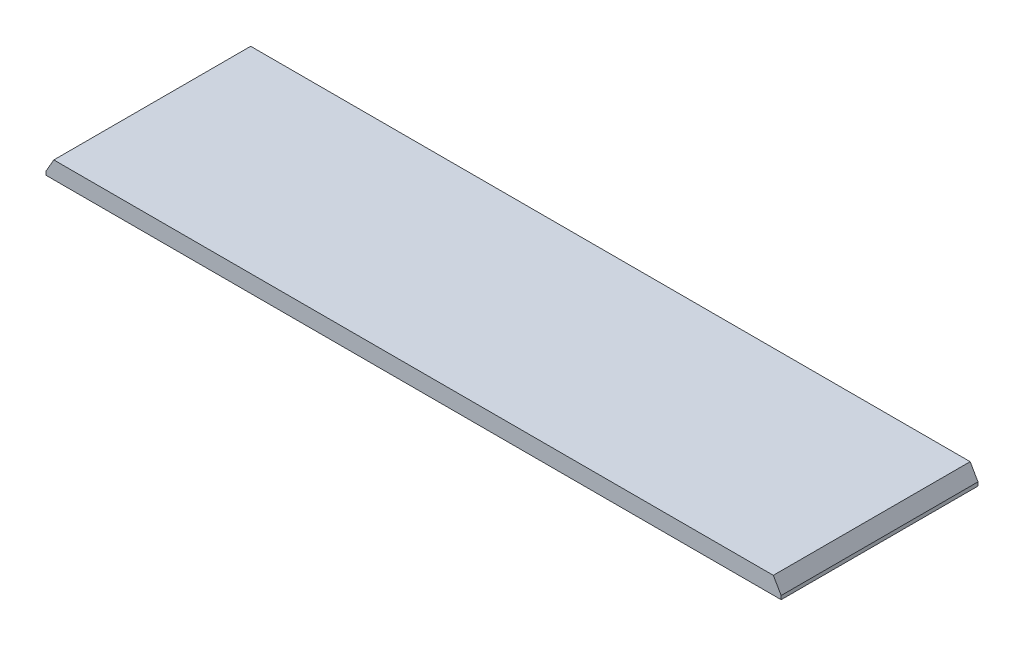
from build123d import *
from OCP.BRepFilletAPI import BRepFilletAPI_MakeChamfer

# Parameters (mm, degrees)
SKETCH3_W           = 1083.083
SKETCH3_H           = 290
BOSS_EXTRUDE1_DEPTH = 25.4
CHAMFER1_SIZE       = 20
CHAMFER1_SIZE2      = 11.547005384


with BuildPart() as part:
    # Sketch3 → Boss-Extrude1 (new body)
    with BuildSketch(Plane(origin=(0, 0, 0), x_dir=(-1, 0, 0), z_dir=(0, 1, 0))):
        Rectangle(SKETCH3_W, SKETCH3_H)
    extrude(amount=BOSS_EXTRUDE1_DEPTH)

    # Chamfer1: one chamfer whose edges measure the first distance from different faces: ONE call of the kernel's chamfer builder (chamfer() names one face for all edges)
    chamfer1_edges_1 = [part.edges().sort_by_distance(p)[0] for p in [
        (-541.5415, 25.4, 0),
    ]]
    chamfer1_side_1 = [part.faces().sort_by_distance(p)[0] for p in [
        (-541.5415, 12.7, 0),
    ]]
    chamfer1_edges_2 = [part.edges().sort_by_distance(p)[0] for p in [
        (541.5415, 25.4, 0),
    ]]
    chamfer1_side_2 = [part.faces().sort_by_distance(p)[0] for p in [
        (541.5415, 12.7, 0),
    ]]
    chamfer1 = BRepFilletAPI_MakeChamfer(part.part.solid().wrapped)
    for e in chamfer1_edges_1:
        chamfer1.Add(CHAMFER1_SIZE, CHAMFER1_SIZE2, e.wrapped, chamfer1_side_1[0].wrapped)  # the first distance lies on this face
    for e in chamfer1_edges_2:
        chamfer1.Add(CHAMFER1_SIZE, CHAMFER1_SIZE2, e.wrapped, chamfer1_side_2[0].wrapped)  # the first distance lies on this face
    add(Compound.cast(chamfer1.Shape()), mode=Mode.REPLACE)


solid = part.part
